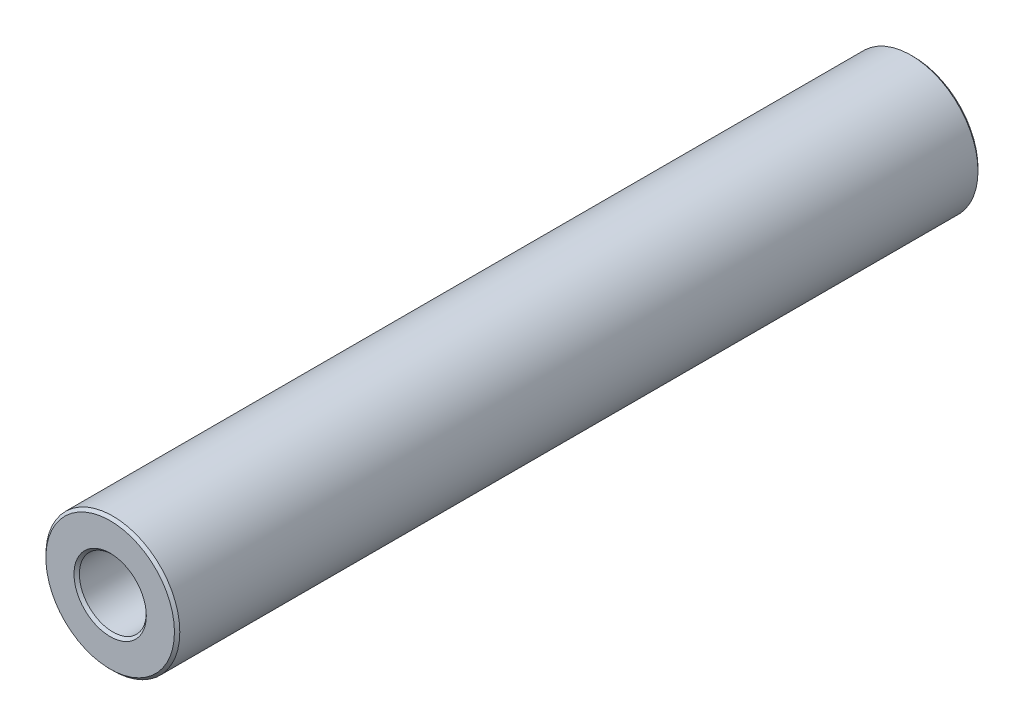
from build123d import *

# Parameters (mm, degrees)
SKETCH1_R           = 2.5
SKETCH1_R_2         = 1.25
BOSS_EXTRUDE2_DEPTH = 15
CHAMFER3_SIZE       = 0.1


with BuildPart() as part:
    # Sketch1 → Boss-Extrude2 (new, symmetric)
    with BuildSketch(Plane.XY):
        Circle(SKETCH1_R)
        Circle(SKETCH1_R_2, mode=Mode.SUBTRACT)
    extrude(amount=BOSS_EXTRUDE2_DEPTH, both=True)

    # Chamfer3
    chamfer3_edges = [part.edges().sort_by_distance(p)[0] for p in [
        (-2.5, 0, -15),
        (-2.5, 0, 15),
        (-1.25, 0, -15),
        (-1.25, 0, 15),
    ]]
    chamfer(chamfer3_edges, length=CHAMFER3_SIZE)


solid = part.part
